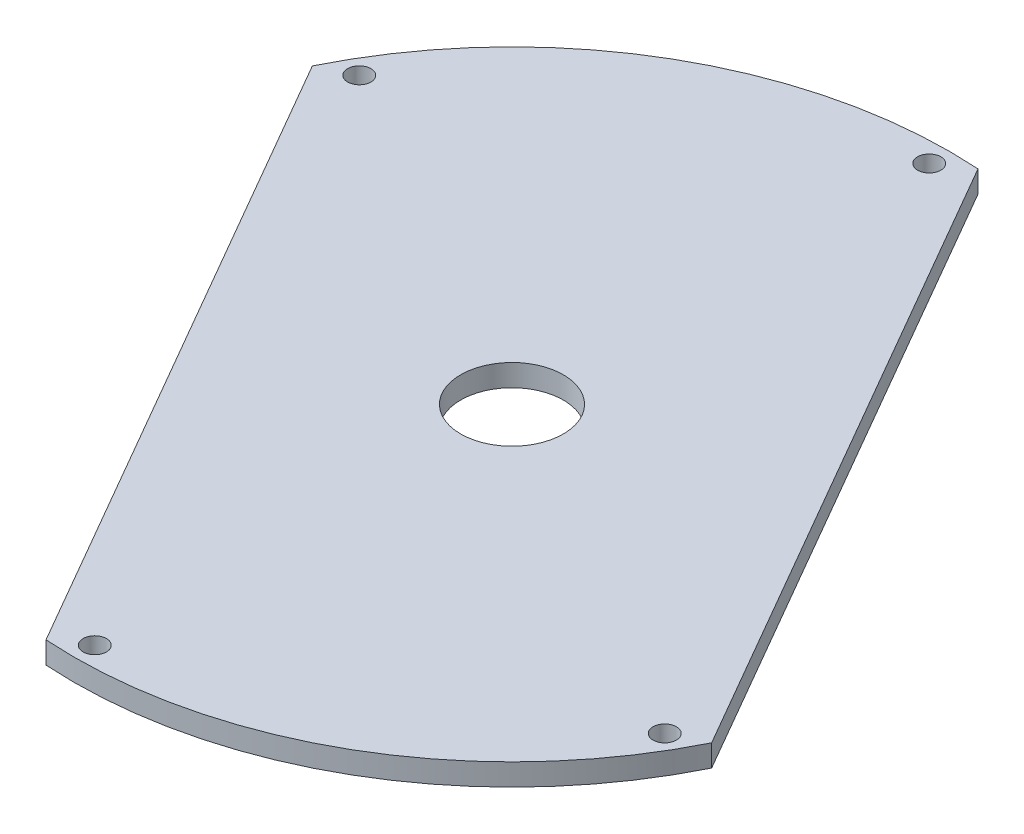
ISO-10303-21;
HEADER;
FILE_DESCRIPTION(('STEP AP214'),'2;1');
FILE_NAME('part.step','',(''),(''),'','','');
FILE_SCHEMA(('AUTOMOTIVE_DESIGN { 1 0 10303 214 1 1 1 1 }'));
ENDSEC;
DATA;
#1=APPLICATION_CONTEXT('core data for automotive mechanical design processes');
#2=APPLICATION_PROTOCOL_DEFINITION('international standard','automotive_design',2000,#1);
#3=PRODUCT_CONTEXT('',#1,'mechanical');
#4=PRODUCT('Part','Part','',(#3));
#5=PRODUCT_RELATED_PRODUCT_CATEGORY('part','',(#4));
#6=PRODUCT_DEFINITION_FORMATION('','',#4);
#7=PRODUCT_DEFINITION_CONTEXT('part definition',#1,'design');
#8=PRODUCT_DEFINITION('design','',#6,#7);
#9=PRODUCT_DEFINITION_SHAPE('','',#8);
#10=(LENGTH_UNIT() NAMED_UNIT(*) SI_UNIT(.MILLI.,.METRE.));
#11=(NAMED_UNIT(*) PLANE_ANGLE_UNIT() SI_UNIT($,.RADIAN.));
#12=(NAMED_UNIT(*) SI_UNIT($,.STERADIAN.) SOLID_ANGLE_UNIT());
#13=UNCERTAINTY_MEASURE_WITH_UNIT(LENGTH_MEASURE(1.E-05),#10,'distance_accuracy_value','');
#14=(GEOMETRIC_REPRESENTATION_CONTEXT(3) GLOBAL_UNCERTAINTY_ASSIGNED_CONTEXT((#13)) GLOBAL_UNIT_ASSIGNED_CONTEXT((#10,
#11,#12)) REPRESENTATION_CONTEXT('',''));
#15=CARTESIAN_POINT('',(0.,0.,0.));
#16=DIRECTION('',(0.,0.,1.));
#17=DIRECTION('',(1.,0.,0.));
#18=AXIS2_PLACEMENT_3D('',#15,#16,#17);
#19=CARTESIAN_POINT('',(0.,6.35,0.));
#20=DIRECTION('',(0.,-1.,0.));
#21=DIRECTION('',(0.,0.,-1.));
#22=AXIS2_PLACEMENT_3D('',#19,#20,#21);
#23=CYLINDRICAL_SURFACE('',#22,127.);
#24=CARTESIAN_POINT('',(0.,6.35,0.));
#25=DIRECTION('',(0.,1.,0.));
#26=DIRECTION('',(0.,0.,1.));
#27=AXIS2_PLACEMENT_3D('',#24,#25,#26);
#28=CIRCLE('',#27,127.);
#29=CARTESIAN_POINT('',(8.43270404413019,6.35,-126.719728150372));
#30=VERTEX_POINT('',#29);
#31=CARTESIAN_POINT('',(-113.958855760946,6.35,-56.0569281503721));
#32=VERTEX_POINT('',#31);
#33=EDGE_CURVE('E91',#30,#32,#28,.T.);
#34=ORIENTED_EDGE('',*,*,#33,.F.);
#35=DIRECTION('',(0.,-1.,0.));
#36=VECTOR('',#35,1.);
#37=CARTESIAN_POINT('',(8.43270404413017,6.35,-126.719728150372));
#38=LINE('',#37,#36);
#39=CARTESIAN_POINT('',(8.43270404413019,0.,-126.719728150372));
#40=VERTEX_POINT('',#39);
#41=EDGE_CURVE('E79',#30,#40,#38,.T.);
#42=ORIENTED_EDGE('',*,*,#41,.T.);
#43=CARTESIAN_POINT('',(0.,0.,0.));
#44=DIRECTION('',(0.,1.,0.));
#45=DIRECTION('',(0.,0.,1.));
#46=AXIS2_PLACEMENT_3D('',#43,#44,#45);
#47=CIRCLE('',#46,127.);
#48=CARTESIAN_POINT('',(-113.958855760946,0.,-56.0569281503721));
#49=VERTEX_POINT('',#48);
#50=EDGE_CURVE('E62',#40,#49,#47,.T.);
#51=ORIENTED_EDGE('',*,*,#50,.T.);
#52=DIRECTION('',(0.,-1.,0.));
#53=VECTOR('',#52,1.);
#54=CARTESIAN_POINT('',(-113.958855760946,6.35,-56.0569281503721));
#55=LINE('',#54,#53);
#56=EDGE_CURVE('E96',#49,#32,#55,.F.);
#57=ORIENTED_EDGE('',*,*,#56,.T.);
#58=EDGE_LOOP('',(#34,#42,#51,#57));
#59=FACE_BOUND('',#58,.T.);
#60=ADVANCED_FACE('F40',(#59),#23,.T.);
#61=CARTESIAN_POINT('',(-8.43270404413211,0.,126.719728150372));
#62=VERTEX_POINT('',#61);
#63=CARTESIAN_POINT('',(113.958855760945,0.,56.0569281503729));
#64=VERTEX_POINT('',#63);
#65=EDGE_CURVE('E97',#62,#64,#47,.T.);
#66=ORIENTED_EDGE('',*,*,#65,.T.);
#67=DIRECTION('',(0.,-1.,0.));
#68=VECTOR('',#67,1.);
#69=CARTESIAN_POINT('',(113.958855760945,6.35,56.0569281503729));
#70=LINE('',#69,#68);
#71=CARTESIAN_POINT('',(113.958855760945,6.35,56.0569281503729));
#72=VERTEX_POINT('',#71);
#73=EDGE_CURVE('E55',#64,#72,#70,.F.);
#74=ORIENTED_EDGE('',*,*,#73,.T.);
#75=CARTESIAN_POINT('',(-8.43270404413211,6.35,126.719728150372));
#76=VERTEX_POINT('',#75);
#77=EDGE_CURVE('E94',#76,#72,#28,.T.);
#78=ORIENTED_EDGE('',*,*,#77,.F.);
#79=DIRECTION('',(0.,-1.,0.));
#80=VECTOR('',#79,1.);
#81=CARTESIAN_POINT('',(-8.43270404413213,6.35,126.719728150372));
#82=LINE('',#81,#80);
#83=EDGE_CURVE('E113',#76,#62,#82,.T.);
#84=ORIENTED_EDGE('',*,*,#83,.T.);
#85=EDGE_LOOP('',(#66,#74,#78,#84));
#86=FACE_BOUND('',#85,.T.);
#87=ADVANCED_FACE('F42',(#86),#23,.T.);
#88=CARTESIAN_POINT('',(0.,6.35,0.));
#89=DIRECTION('',(0.,1.,0.));
#90=DIRECTION('',(0.,0.,1.));
#91=AXIS2_PLACEMENT_3D('',#88,#89,#90);
#92=PLANE('',#91);
#93=DIRECTION('',(0.500000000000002,0.,0.866025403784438));
#94=VECTOR('',#93,1.);
#95=CARTESIAN_POINT('',(-5.62603406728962,6.35,-151.070176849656));
#96=LINE('',#95,#94);
#97=EDGE_CURVE('E82',#30,#72,#96,.T.);
#98=ORIENTED_EDGE('',*,*,#97,.F.);
#99=ORIENTED_EDGE('',*,*,#33,.T.);
#100=DIRECTION('',(-0.499999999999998,0.,-0.86602540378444));
#101=VECTOR('',#100,1.);
#102=CARTESIAN_POINT('',(-128.017593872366,6.35,-80.4073768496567));
#103=LINE('',#102,#101);
#104=EDGE_CURVE('E84',#76,#32,#103,.T.);
#105=ORIENTED_EDGE('',*,*,#104,.F.);
#106=ORIENTED_EDGE('',*,*,#77,.T.);
#107=EDGE_LOOP('',(#98,#99,#105,#106));
#108=FACE_BOUND('',#107,.T.);
#109=CARTESIAN_POINT('',(104.793923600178,6.35,60.5028000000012));
#110=DIRECTION('',(0.,1.,0.));
#111=DIRECTION('',(0.,0.,1.));
#112=AXIS2_PLACEMENT_3D('',#109,#110,#111);
#113=CIRCLE('',#112,3.37819999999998);
#114=CARTESIAN_POINT('',(104.793923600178,6.35,63.8810000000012));
#115=VERTEX_POINT('',#114);
#116=EDGE_CURVE('E118',#115,#115,#113,.T.);
#117=ORIENTED_EDGE('',*,*,#116,.F.);
#118=EDGE_LOOP('',(#117));
#119=FACE_BOUND('',#118,.T.);
#120=CARTESIAN_POINT('',(8.44978078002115E-13,6.35,-121.0056));
#121=DIRECTION('',(0.,1.,0.));
#122=DIRECTION('',(0.,0.,1.));
#123=AXIS2_PLACEMENT_3D('',#120,#121,#122);
#124=CIRCLE('',#123,3.37819999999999);
#125=CARTESIAN_POINT('',(8.44978078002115E-13,6.35,-117.6274));
#126=VERTEX_POINT('',#125);
#127=EDGE_CURVE('E128',#126,#126,#124,.T.);
#128=ORIENTED_EDGE('',*,*,#127,.F.);
#129=EDGE_LOOP('',(#128));
#130=FACE_BOUND('',#129,.T.);
#131=CARTESIAN_POINT('',(-104.793923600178,6.35,-60.5028000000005));
#132=DIRECTION('',(0.,1.,0.));
#133=DIRECTION('',(0.,0.,1.));
#134=AXIS2_PLACEMENT_3D('',#131,#132,#133);
#135=CIRCLE('',#134,3.37819999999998);
#136=CARTESIAN_POINT('',(-104.793923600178,6.35,-57.1246000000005));
#137=VERTEX_POINT('',#136);
#138=EDGE_CURVE('E134',#137,#137,#135,.T.);
#139=ORIENTED_EDGE('',*,*,#138,.F.);
#140=EDGE_LOOP('',(#139));
#141=FACE_BOUND('',#140,.T.);
#142=CARTESIAN_POINT('',(0.,6.35,121.0056));
#143=DIRECTION('',(0.,1.,0.));
#144=DIRECTION('',(0.,0.,1.));
#145=AXIS2_PLACEMENT_3D('',#142,#143,#144);
#146=CIRCLE('',#145,3.37819999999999);
#147=CARTESIAN_POINT('',(0.,6.35,124.3838));
#148=VERTEX_POINT('',#147);
#149=EDGE_CURVE('E141',#148,#148,#146,.T.);
#150=ORIENTED_EDGE('',*,*,#149,.F.);
#151=EDGE_LOOP('',(#150));
#152=FACE_BOUND('',#151,.T.);
#153=CARTESIAN_POINT('',(0.,6.35,0.));
#154=DIRECTION('',(0.,1.,0.));
#155=DIRECTION('',(0.,0.,1.));
#156=AXIS2_PLACEMENT_3D('',#153,#154,#155);
#157=CIRCLE('',#156,14.88313);
#158=CARTESIAN_POINT('',(0.,6.35,14.88313));
#159=VERTEX_POINT('',#158);
#160=EDGE_CURVE('E147',#159,#159,#157,.T.);
#161=ORIENTED_EDGE('',*,*,#160,.F.);
#162=EDGE_LOOP('',(#161));
#163=FACE_BOUND('',#162,.T.);
#164=ADVANCED_FACE('F88',(#108,#119,#130,#141,#152,#163),#92,.T.);
#165=CARTESIAN_POINT('',(0.,0.,0.));
#166=DIRECTION('',(0.,1.,0.));
#167=DIRECTION('',(0.,0.,1.));
#168=AXIS2_PLACEMENT_3D('',#165,#166,#167);
#169=PLANE('',#168);
#170=CARTESIAN_POINT('',(104.793923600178,0.,60.5028000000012));
#171=DIRECTION('',(0.,1.,0.));
#172=DIRECTION('',(0.,0.,1.));
#173=AXIS2_PLACEMENT_3D('',#170,#171,#172);
#174=CIRCLE('',#173,3.37819999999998);
#175=CARTESIAN_POINT('',(104.793923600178,0.,63.8810000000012));
#176=VERTEX_POINT('',#175);
#177=EDGE_CURVE('E115',#176,#176,#174,.T.);
#178=ORIENTED_EDGE('',*,*,#177,.T.);
#179=EDGE_LOOP('',(#178));
#180=FACE_BOUND('',#179,.T.);
#181=CARTESIAN_POINT('',(8.44978078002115E-13,0.,-121.0056));
#182=DIRECTION('',(0.,1.,0.));
#183=DIRECTION('',(0.,0.,1.));
#184=AXIS2_PLACEMENT_3D('',#181,#182,#183);
#185=CIRCLE('',#184,3.37819999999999);
#186=CARTESIAN_POINT('',(8.44978078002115E-13,0.,-117.6274));
#187=VERTEX_POINT('',#186);
#188=EDGE_CURVE('E125',#187,#187,#185,.T.);
#189=ORIENTED_EDGE('',*,*,#188,.T.);
#190=EDGE_LOOP('',(#189));
#191=FACE_BOUND('',#190,.T.);
#192=CARTESIAN_POINT('',(-104.793923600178,0.,-60.5028000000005));
#193=DIRECTION('',(0.,1.,0.));
#194=DIRECTION('',(0.,0.,1.));
#195=AXIS2_PLACEMENT_3D('',#192,#193,#194);
#196=CIRCLE('',#195,3.37819999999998);
#197=CARTESIAN_POINT('',(-104.793923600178,0.,-57.1246000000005));
#198=VERTEX_POINT('',#197);
#199=EDGE_CURVE('E131',#198,#198,#196,.T.);
#200=ORIENTED_EDGE('',*,*,#199,.T.);
#201=EDGE_LOOP('',(#200));
#202=FACE_BOUND('',#201,.T.);
#203=CARTESIAN_POINT('',(0.,0.,121.0056));
#204=DIRECTION('',(0.,1.,0.));
#205=DIRECTION('',(0.,0.,1.));
#206=AXIS2_PLACEMENT_3D('',#203,#204,#205);
#207=CIRCLE('',#206,3.37819999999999);
#208=CARTESIAN_POINT('',(0.,0.,124.3838));
#209=VERTEX_POINT('',#208);
#210=EDGE_CURVE('E137',#209,#209,#207,.T.);
#211=ORIENTED_EDGE('',*,*,#210,.T.);
#212=EDGE_LOOP('',(#211));
#213=FACE_BOUND('',#212,.T.);
#214=CARTESIAN_POINT('',(0.,0.,0.));
#215=DIRECTION('',(0.,1.,0.));
#216=DIRECTION('',(0.,0.,1.));
#217=AXIS2_PLACEMENT_3D('',#214,#215,#216);
#218=CIRCLE('',#217,14.88313);
#219=CARTESIAN_POINT('',(0.,0.,14.88313));
#220=VERTEX_POINT('',#219);
#221=EDGE_CURVE('E145',#220,#220,#218,.T.);
#222=ORIENTED_EDGE('',*,*,#221,.T.);
#223=EDGE_LOOP('',(#222));
#224=FACE_BOUND('',#223,.T.);
#225=ORIENTED_EDGE('',*,*,#50,.F.);
#226=DIRECTION('',(0.500000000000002,0.,0.866025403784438));
#227=VECTOR('',#226,1.);
#228=CARTESIAN_POINT('',(61.1957799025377,0.,-35.3313999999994));
#229=LINE('',#228,#227);
#230=EDGE_CURVE('E11',#40,#64,#229,.T.);
#231=ORIENTED_EDGE('',*,*,#230,.T.);
#232=ORIENTED_EDGE('',*,*,#65,.F.);
#233=DIRECTION('',(-0.499999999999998,0.,-0.86602540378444));
#234=VECTOR('',#233,1.);
#235=CARTESIAN_POINT('',(-61.1957799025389,0.,35.3313999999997));
#236=LINE('',#235,#234);
#237=EDGE_CURVE('E48',#62,#49,#236,.T.);
#238=ORIENTED_EDGE('',*,*,#237,.T.);
#239=EDGE_LOOP('',(#225,#231,#232,#238));
#240=FACE_BOUND('',#239,.T.);
#241=ADVANCED_FACE('F109',(#180,#191,#202,#213,#224,#240),#169,.F.);
#242=CARTESIAN_POINT('',(0.,6.35,0.));
#243=DIRECTION('',(0.,1.,0.));
#244=DIRECTION('',(0.,0.,1.));
#245=AXIS2_PLACEMENT_3D('',#242,#243,#244);
#246=CYLINDRICAL_SURFACE('',#245,14.88313);
#247=ORIENTED_EDGE('',*,*,#221,.F.);
#248=EDGE_LOOP('',(#247));
#249=FACE_BOUND('',#248,.T.);
#250=ORIENTED_EDGE('',*,*,#160,.T.);
#251=EDGE_LOOP('',(#250));
#252=FACE_BOUND('',#251,.T.);
#253=ADVANCED_FACE('F151',(#249,#252),#246,.F.);
#254=CARTESIAN_POINT('',(0.,6.35,121.0056));
#255=DIRECTION('',(0.,1.,0.));
#256=DIRECTION('',(0.,0.,1.));
#257=AXIS2_PLACEMENT_3D('',#254,#255,#256);
#258=CYLINDRICAL_SURFACE('',#257,3.37819999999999);
#259=ORIENTED_EDGE('',*,*,#210,.F.);
#260=EDGE_LOOP('',(#259));
#261=FACE_BOUND('',#260,.T.);
#262=ORIENTED_EDGE('',*,*,#149,.T.);
#263=EDGE_LOOP('',(#262));
#264=FACE_BOUND('',#263,.T.);
#265=ADVANCED_FACE('F222',(#261,#264),#258,.F.);
#266=CARTESIAN_POINT('',(-104.793923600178,6.35,-60.5028000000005));
#267=DIRECTION('',(0.,1.,0.));
#268=DIRECTION('',(0.,0.,1.));
#269=AXIS2_PLACEMENT_3D('',#266,#267,#268);
#270=CYLINDRICAL_SURFACE('',#269,3.37819999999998);
#271=ORIENTED_EDGE('',*,*,#199,.F.);
#272=EDGE_LOOP('',(#271));
#273=FACE_BOUND('',#272,.T.);
#274=ORIENTED_EDGE('',*,*,#138,.T.);
#275=EDGE_LOOP('',(#274));
#276=FACE_BOUND('',#275,.T.);
#277=ADVANCED_FACE('F214',(#273,#276),#270,.F.);
#278=CARTESIAN_POINT('',(8.44978078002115E-13,6.35,-121.0056));
#279=DIRECTION('',(0.,1.,0.));
#280=DIRECTION('',(0.,0.,1.));
#281=AXIS2_PLACEMENT_3D('',#278,#279,#280);
#282=CYLINDRICAL_SURFACE('',#281,3.37819999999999);
#283=ORIENTED_EDGE('',*,*,#188,.F.);
#284=EDGE_LOOP('',(#283));
#285=FACE_BOUND('',#284,.T.);
#286=ORIENTED_EDGE('',*,*,#127,.T.);
#287=EDGE_LOOP('',(#286));
#288=FACE_BOUND('',#287,.T.);
#289=ADVANCED_FACE('F206',(#285,#288),#282,.F.);
#290=CARTESIAN_POINT('',(104.793923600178,6.35,60.5028000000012));
#291=DIRECTION('',(0.,1.,0.));
#292=DIRECTION('',(0.,0.,1.));
#293=AXIS2_PLACEMENT_3D('',#290,#291,#292);
#294=CYLINDRICAL_SURFACE('',#293,3.37819999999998);
#295=ORIENTED_EDGE('',*,*,#177,.F.);
#296=EDGE_LOOP('',(#295));
#297=FACE_BOUND('',#296,.T.);
#298=ORIENTED_EDGE('',*,*,#116,.T.);
#299=EDGE_LOOP('',(#298));
#300=FACE_BOUND('',#299,.T.);
#301=ADVANCED_FACE('F191',(#297,#300),#294,.F.);
#302=CARTESIAN_POINT('',(-128.017593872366,0.,-80.4073768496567));
#303=DIRECTION('',(0.86602540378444,0.,-0.499999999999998));
#304=DIRECTION('',(-0.499999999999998,0.,-0.86602540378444));
#305=AXIS2_PLACEMENT_3D('',#302,#303,#304);
#306=PLANE('',#305);
#307=ORIENTED_EDGE('',*,*,#104,.T.);
#308=ORIENTED_EDGE('',*,*,#56,.F.);
#309=ORIENTED_EDGE('',*,*,#237,.F.);
#310=ORIENTED_EDGE('',*,*,#83,.F.);
#311=EDGE_LOOP('',(#307,#308,#309,#310));
#312=FACE_BOUND('',#311,.T.);
#313=ADVANCED_FACE('F112',(#312),#306,.F.);
#314=CARTESIAN_POINT('',(-5.62603406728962,0.,-151.070176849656));
#315=DIRECTION('',(-0.866025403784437,0.,0.500000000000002));
#316=DIRECTION('',(0.500000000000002,0.,0.866025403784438));
#317=AXIS2_PLACEMENT_3D('',#314,#315,#316);
#318=PLANE('',#317);
#319=ORIENTED_EDGE('',*,*,#97,.T.);
#320=ORIENTED_EDGE('',*,*,#73,.F.);
#321=ORIENTED_EDGE('',*,*,#230,.F.);
#322=ORIENTED_EDGE('',*,*,#41,.F.);
#323=EDGE_LOOP('',(#319,#320,#321,#322));
#324=FACE_BOUND('',#323,.T.);
#325=ADVANCED_FACE('F81',(#324),#318,.F.);
#326=CLOSED_SHELL('',(#60,#87,#164,#241,#253,#265,#277,#289,#301,#313,#325));
#327=MANIFOLD_SOLID_BREP('B2',#326);
#328=ADVANCED_BREP_SHAPE_REPRESENTATION('',(#18,#327),#14);
#329=SHAPE_DEFINITION_REPRESENTATION(#9,#328);
ENDSEC;
END-ISO-10303-21;
